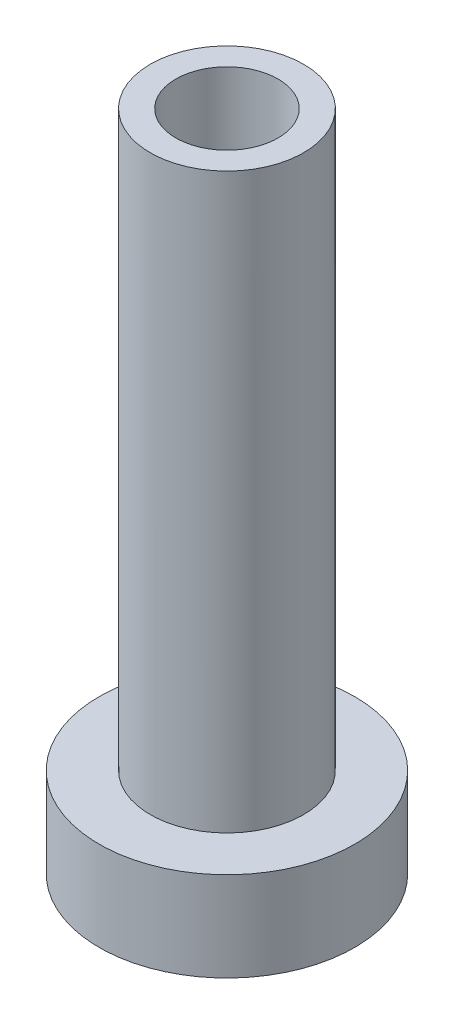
ISO-10303-21;
HEADER;
FILE_DESCRIPTION(('STEP AP214'),'2;1');
FILE_NAME('part.step','',(''),(''),'','','');
FILE_SCHEMA(('AUTOMOTIVE_DESIGN { 1 0 10303 214 1 1 1 1 }'));
ENDSEC;
DATA;
#1=APPLICATION_CONTEXT('core data for automotive mechanical design processes');
#2=APPLICATION_PROTOCOL_DEFINITION('international standard','automotive_design',2000,#1);
#3=PRODUCT_CONTEXT('',#1,'mechanical');
#4=PRODUCT('Part','Part','',(#3));
#5=PRODUCT_RELATED_PRODUCT_CATEGORY('part','',(#4));
#6=PRODUCT_DEFINITION_FORMATION('','',#4);
#7=PRODUCT_DEFINITION_CONTEXT('part definition',#1,'design');
#8=PRODUCT_DEFINITION('design','',#6,#7);
#9=PRODUCT_DEFINITION_SHAPE('','',#8);
#10=(LENGTH_UNIT() NAMED_UNIT(*) SI_UNIT(.MILLI.,.METRE.));
#11=(NAMED_UNIT(*) PLANE_ANGLE_UNIT() SI_UNIT($,.RADIAN.));
#12=(NAMED_UNIT(*) SI_UNIT($,.STERADIAN.) SOLID_ANGLE_UNIT());
#13=UNCERTAINTY_MEASURE_WITH_UNIT(LENGTH_MEASURE(1.E-05),#10,'distance_accuracy_value','');
#14=(GEOMETRIC_REPRESENTATION_CONTEXT(3) GLOBAL_UNCERTAINTY_ASSIGNED_CONTEXT((#13)) GLOBAL_UNIT_ASSIGNED_CONTEXT((#10,
#11,#12)) REPRESENTATION_CONTEXT('',''));
#15=CARTESIAN_POINT('',(0.,0.,0.));
#16=DIRECTION('',(0.,0.,1.));
#17=DIRECTION('',(1.,0.,0.));
#18=AXIS2_PLACEMENT_3D('',#15,#16,#17);
#19=CARTESIAN_POINT('',(0.,0.,0.));
#20=DIRECTION('',(0.,-1.,0.));
#21=DIRECTION('',(0.,0.,-1.));
#22=AXIS2_PLACEMENT_3D('',#19,#20,#21);
#23=CYLINDRICAL_SURFACE('',#22,6.);
#24=CARTESIAN_POINT('',(0.,7.,0.));
#25=DIRECTION('',(0.,-1.,0.));
#26=DIRECTION('',(0.,0.,-1.));
#27=AXIS2_PLACEMENT_3D('',#24,#25,#26);
#28=CIRCLE('',#27,6.);
#29=CARTESIAN_POINT('',(0.,7.,-6.));
#30=VERTEX_POINT('',#29);
#31=EDGE_CURVE('E53',#30,#30,#28,.T.);
#32=ORIENTED_EDGE('',*,*,#31,.F.);
#33=EDGE_LOOP('',(#32));
#34=FACE_BOUND('',#33,.T.);
#35=CARTESIAN_POINT('',(0.,51.85,0.));
#36=DIRECTION('',(0.,1.,0.));
#37=DIRECTION('',(-1.,0.,0.));
#38=AXIS2_PLACEMENT_3D('',#35,#36,#37);
#39=CIRCLE('',#38,6.);
#40=CARTESIAN_POINT('',(-6.,51.85,0.));
#41=VERTEX_POINT('',#40);
#42=EDGE_CURVE('E60',#41,#41,#39,.F.);
#43=ORIENTED_EDGE('',*,*,#42,.T.);
#44=EDGE_LOOP('',(#43));
#45=FACE_BOUND('',#44,.T.);
#46=ADVANCED_FACE('F31',(#34,#45),#23,.T.);
#47=CARTESIAN_POINT('',(0.,0.,0.));
#48=DIRECTION('',(0.,-1.,0.));
#49=DIRECTION('',(0.,0.,-1.));
#50=AXIS2_PLACEMENT_3D('',#47,#48,#49);
#51=CYLINDRICAL_SURFACE('',#50,4.);
#52=CARTESIAN_POINT('',(0.,40.,0.));
#53=DIRECTION('',(0.,1.,0.));
#54=DIRECTION('',(0.,0.,1.));
#55=AXIS2_PLACEMENT_3D('',#52,#53,#54);
#56=CIRCLE('',#55,4.);
#57=CARTESIAN_POINT('',(0.,40.,4.));
#58=VERTEX_POINT('',#57);
#59=EDGE_CURVE('E46',#58,#58,#56,.F.);
#60=ORIENTED_EDGE('',*,*,#59,.T.);
#61=EDGE_LOOP('',(#60));
#62=FACE_BOUND('',#61,.T.);
#63=CARTESIAN_POINT('',(0.,51.85,0.));
#64=DIRECTION('',(0.,1.,0.));
#65=DIRECTION('',(-1.,0.,0.));
#66=AXIS2_PLACEMENT_3D('',#63,#64,#65);
#67=CIRCLE('',#66,4.);
#68=CARTESIAN_POINT('',(-4.,51.85,0.));
#69=VERTEX_POINT('',#68);
#70=EDGE_CURVE('E35',#69,#69,#67,.F.);
#71=ORIENTED_EDGE('',*,*,#70,.F.);
#72=EDGE_LOOP('',(#71));
#73=FACE_BOUND('',#72,.T.);
#74=ADVANCED_FACE('F69',(#62,#73),#51,.F.);
#75=CARTESIAN_POINT('',(-3.99999999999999,0.,0.));
#76=DIRECTION('',(0.,1.,0.));
#77=DIRECTION('',(0.,0.,1.));
#78=AXIS2_PLACEMENT_3D('',#75,#76,#77);
#79=PLANE('',#78);
#80=CARTESIAN_POINT('',(0.,0.,0.));
#81=DIRECTION('',(0.,1.,0.));
#82=DIRECTION('',(0.,0.,1.));
#83=AXIS2_PLACEMENT_3D('',#80,#81,#82);
#84=CIRCLE('',#83,5.25000000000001);
#85=CARTESIAN_POINT('',(0.,0.,5.25000000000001));
#86=VERTEX_POINT('',#85);
#87=EDGE_CURVE('E39',#86,#86,#84,.T.);
#88=ORIENTED_EDGE('',*,*,#87,.T.);
#89=EDGE_LOOP('',(#88));
#90=FACE_BOUND('',#89,.T.);
#91=CARTESIAN_POINT('',(0.,0.,0.));
#92=DIRECTION('',(0.,-1.,0.));
#93=DIRECTION('',(0.,0.,-1.));
#94=AXIS2_PLACEMENT_3D('',#91,#92,#93);
#95=CIRCLE('',#94,9.99999999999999);
#96=CARTESIAN_POINT('',(0.,0.,-9.99999999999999));
#97=VERTEX_POINT('',#96);
#98=EDGE_CURVE('E49',#97,#97,#95,.T.);
#99=ORIENTED_EDGE('',*,*,#98,.T.);
#100=EDGE_LOOP('',(#99));
#101=FACE_BOUND('',#100,.T.);
#102=ADVANCED_FACE('F71',(#90,#101),#79,.F.);
#103=CARTESIAN_POINT('',(0.,0.,0.));
#104=DIRECTION('',(0.,-1.,0.));
#105=DIRECTION('',(0.,0.,-1.));
#106=AXIS2_PLACEMENT_3D('',#103,#104,#105);
#107=CYLINDRICAL_SURFACE('',#106,10.);
#108=ORIENTED_EDGE('',*,*,#98,.F.);
#109=EDGE_LOOP('',(#108));
#110=FACE_BOUND('',#109,.T.);
#111=CARTESIAN_POINT('',(0.,7.,0.));
#112=DIRECTION('',(0.,-1.,0.));
#113=DIRECTION('',(0.,0.,-1.));
#114=AXIS2_PLACEMENT_3D('',#111,#112,#113);
#115=CIRCLE('',#114,10.);
#116=CARTESIAN_POINT('',(0.,7.,-10.));
#117=VERTEX_POINT('',#116);
#118=EDGE_CURVE('E43',#117,#117,#115,.T.);
#119=ORIENTED_EDGE('',*,*,#118,.T.);
#120=EDGE_LOOP('',(#119));
#121=FACE_BOUND('',#120,.T.);
#122=ADVANCED_FACE('F78',(#110,#121),#107,.T.);
#123=CARTESIAN_POINT('',(-10.,7.,0.));
#124=DIRECTION('',(0.,-1.,0.));
#125=DIRECTION('',(0.,0.,-1.));
#126=AXIS2_PLACEMENT_3D('',#123,#124,#125);
#127=PLANE('',#126);
#128=ORIENTED_EDGE('',*,*,#118,.F.);
#129=EDGE_LOOP('',(#128));
#130=FACE_BOUND('',#129,.T.);
#131=ORIENTED_EDGE('',*,*,#31,.T.);
#132=EDGE_LOOP('',(#131));
#133=FACE_BOUND('',#132,.T.);
#134=ADVANCED_FACE('F85',(#130,#133),#127,.F.);
#135=CARTESIAN_POINT('',(0.,40.,0.));
#136=DIRECTION('',(0.,1.,0.));
#137=DIRECTION('',(0.,0.,1.));
#138=AXIS2_PLACEMENT_3D('',#135,#136,#137);
#139=PLANE('',#138);
#140=CARTESIAN_POINT('',(0.,40.,0.));
#141=DIRECTION('',(0.,1.,0.));
#142=DIRECTION('',(0.,0.,1.));
#143=AXIS2_PLACEMENT_3D('',#140,#141,#142);
#144=CIRCLE('',#143,4.25);
#145=CARTESIAN_POINT('',(0.,40.,4.25));
#146=VERTEX_POINT('',#145);
#147=EDGE_CURVE('E50',#146,#146,#144,.T.);
#148=ORIENTED_EDGE('',*,*,#147,.F.);
#149=EDGE_LOOP('',(#148));
#150=FACE_BOUND('',#149,.T.);
#151=ORIENTED_EDGE('',*,*,#59,.F.);
#152=EDGE_LOOP('',(#151));
#153=FACE_BOUND('',#152,.T.);
#154=ADVANCED_FACE('F87',(#150,#153),#139,.F.);
#155=CARTESIAN_POINT('',(0.,40.,0.));
#156=DIRECTION('',(0.,-1.,0.));
#157=DIRECTION('',(0.,0.,-1.));
#158=AXIS2_PLACEMENT_3D('',#155,#156,#157);
#159=CYLINDRICAL_SURFACE('',#158,4.25);
#160=CARTESIAN_POINT('',(0.,1.00000000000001,0.));
#161=DIRECTION('',(0.,1.,0.));
#162=DIRECTION('',(0.,0.,1.));
#163=AXIS2_PLACEMENT_3D('',#160,#161,#162);
#164=CIRCLE('',#163,4.25);
#165=CARTESIAN_POINT('',(0.,1.00000000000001,4.25));
#166=VERTEX_POINT('',#165);
#167=EDGE_CURVE('E10',#166,#166,#164,.F.);
#168=ORIENTED_EDGE('',*,*,#167,.T.);
#169=EDGE_LOOP('',(#168));
#170=FACE_BOUND('',#169,.T.);
#171=ORIENTED_EDGE('',*,*,#147,.T.);
#172=EDGE_LOOP('',(#171));
#173=FACE_BOUND('',#172,.T.);
#174=ADVANCED_FACE('F111',(#170,#173),#159,.F.);
#175=CARTESIAN_POINT('',(0.,0.,0.));
#176=DIRECTION('',(0.,-1.,0.));
#177=DIRECTION('',(0.,0.,-1.));
#178=AXIS2_PLACEMENT_3D('',#175,#176,#177);
#179=CONICAL_SURFACE('',#178,5.25000000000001,0.785398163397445);
#180=ORIENTED_EDGE('',*,*,#167,.F.);
#181=EDGE_LOOP('',(#180));
#182=FACE_BOUND('',#181,.T.);
#183=ORIENTED_EDGE('',*,*,#87,.F.);
#184=EDGE_LOOP('',(#183));
#185=FACE_BOUND('',#184,.T.);
#186=ADVANCED_FACE('F33',(#182,#185),#179,.F.);
#187=CARTESIAN_POINT('',(0.,51.85,0.));
#188=DIRECTION('',(0.,1.,0.));
#189=DIRECTION('',(0.0775361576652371,0.,-0.996989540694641));
#190=AXIS2_PLACEMENT_3D('',#187,#188,#189);
#191=PLANE('',#190);
#192=ORIENTED_EDGE('',*,*,#42,.F.);
#193=EDGE_LOOP('',(#192));
#194=FACE_BOUND('',#193,.T.);
#195=ORIENTED_EDGE('',*,*,#70,.T.);
#196=EDGE_LOOP('',(#195));
#197=FACE_BOUND('',#196,.T.);
#198=ADVANCED_FACE('F67',(#194,#197),#191,.T.);
#199=CLOSED_SHELL('',(#46,#74,#102,#122,#134,#154,#174,#186,#198));
#200=MANIFOLD_SOLID_BREP('B2',#199);
#201=ADVANCED_BREP_SHAPE_REPRESENTATION('',(#18,#200),#14);
#202=SHAPE_DEFINITION_REPRESENTATION(#9,#201);
ENDSEC;
END-ISO-10303-21;
